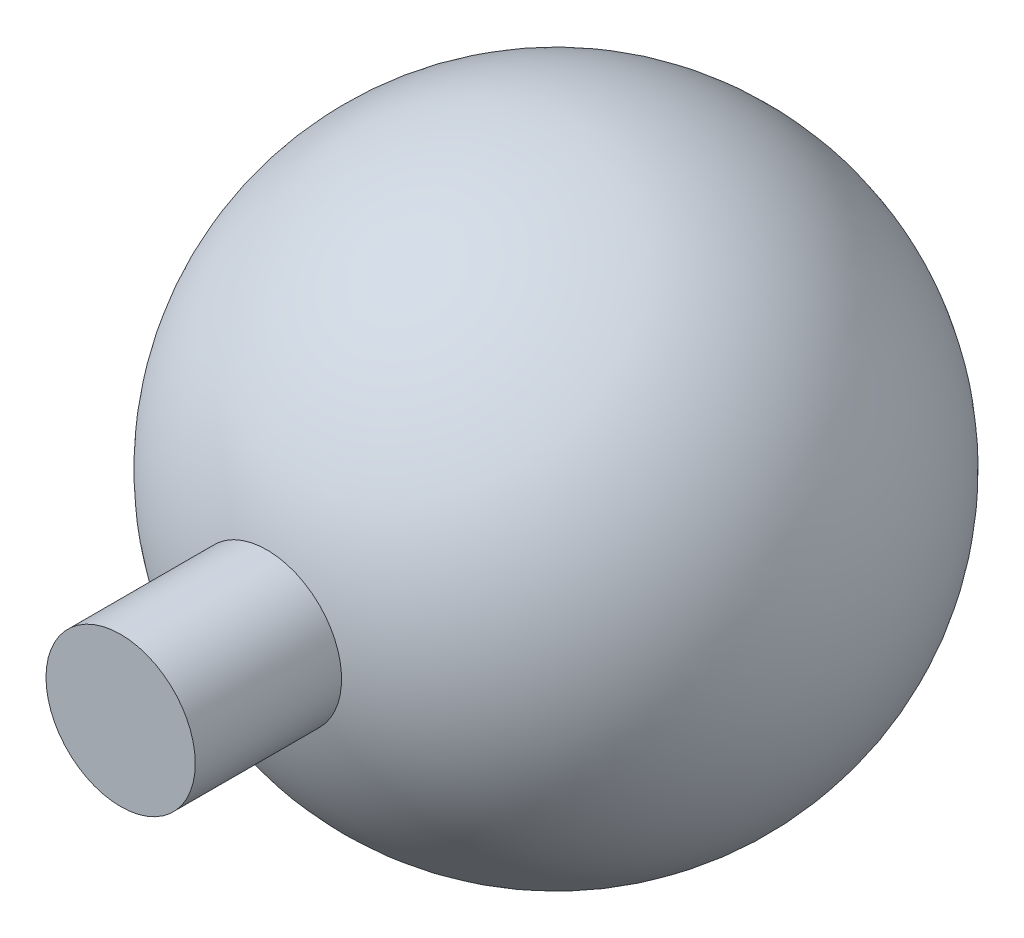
ISO-10303-21;
HEADER;
FILE_DESCRIPTION(('STEP AP214'),'2;1');
FILE_NAME('part.step','',(''),(''),'','','');
FILE_SCHEMA(('AUTOMOTIVE_DESIGN { 1 0 10303 214 1 1 1 1 }'));
ENDSEC;
DATA;
#1=APPLICATION_CONTEXT('core data for automotive mechanical design processes');
#2=APPLICATION_PROTOCOL_DEFINITION('international standard','automotive_design',2000,#1);
#3=PRODUCT_CONTEXT('',#1,'mechanical');
#4=PRODUCT('Part','Part','',(#3));
#5=PRODUCT_RELATED_PRODUCT_CATEGORY('part','',(#4));
#6=PRODUCT_DEFINITION_FORMATION('','',#4);
#7=PRODUCT_DEFINITION_CONTEXT('part definition',#1,'design');
#8=PRODUCT_DEFINITION('design','',#6,#7);
#9=PRODUCT_DEFINITION_SHAPE('','',#8);
#10=(LENGTH_UNIT() NAMED_UNIT(*) SI_UNIT(.MILLI.,.METRE.));
#11=(NAMED_UNIT(*) PLANE_ANGLE_UNIT() SI_UNIT($,.RADIAN.));
#12=(NAMED_UNIT(*) SI_UNIT($,.STERADIAN.) SOLID_ANGLE_UNIT());
#13=UNCERTAINTY_MEASURE_WITH_UNIT(LENGTH_MEASURE(1.E-05),#10,'distance_accuracy_value','');
#14=(GEOMETRIC_REPRESENTATION_CONTEXT(3) GLOBAL_UNCERTAINTY_ASSIGNED_CONTEXT((#13)) GLOBAL_UNIT_ASSIGNED_CONTEXT((#10,
#11,#12)) REPRESENTATION_CONTEXT('',''));
#15=CARTESIAN_POINT('',(0.,0.,0.));
#16=DIRECTION('',(0.,0.,1.));
#17=DIRECTION('',(1.,0.,0.));
#18=AXIS2_PLACEMENT_3D('',#15,#16,#17);
#19=CARTESIAN_POINT('',(0.,0.,70.));
#20=DIRECTION('',(0.,0.,-1.));
#21=DIRECTION('',(-1.,0.,0.));
#22=AXIS2_PLACEMENT_3D('',#19,#20,#21);
#23=CYLINDRICAL_SURFACE('',#22,12.);
#24=CARTESIAN_POINT('',(0.,0.,46.475800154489));
#25=DIRECTION('',(0.,0.,-1.));
#26=DIRECTION('',(-1.,0.,0.));
#27=AXIS2_PLACEMENT_3D('',#24,#25,#26);
#28=CIRCLE('',#27,12.);
#29=CARTESIAN_POINT('',(-12.,0.,46.475800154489));
#30=VERTEX_POINT('',#29);
#31=EDGE_CURVE('E10',#30,#30,#28,.T.);
#32=ORIENTED_EDGE('',*,*,#31,.F.);
#33=EDGE_LOOP('',(#32));
#34=FACE_BOUND('',#33,.T.);
#35=CARTESIAN_POINT('',(0.,0.,70.));
#36=DIRECTION('',(0.,0.,1.));
#37=DIRECTION('',(1.,0.,0.));
#38=AXIS2_PLACEMENT_3D('',#35,#36,#37);
#39=CIRCLE('',#38,12.);
#40=CARTESIAN_POINT('',(12.,0.,70.));
#41=VERTEX_POINT('',#40);
#42=EDGE_CURVE('E41',#41,#41,#39,.T.);
#43=ORIENTED_EDGE('',*,*,#42,.F.);
#44=EDGE_LOOP('',(#43));
#45=FACE_BOUND('',#44,.T.);
#46=ADVANCED_FACE('F34',(#34,#45),#23,.T.);
#47=CARTESIAN_POINT('',(0.,0.,70.));
#48=DIRECTION('',(0.,0.,1.));
#49=DIRECTION('',(1.,0.,0.));
#50=AXIS2_PLACEMENT_3D('',#47,#48,#49);
#51=PLANE('',#50);
#52=ORIENTED_EDGE('',*,*,#42,.T.);
#53=EDGE_LOOP('',(#52));
#54=FACE_BOUND('',#53,.T.);
#55=ADVANCED_FACE('F47',(#54),#51,.T.);
#56=CARTESIAN_POINT('',(0.,0.,0.));
#57=DIRECTION('',(0.,-1.,0.));
#58=DIRECTION('',(-1.,0.,0.));
#59=AXIS2_PLACEMENT_3D('',#56,#57,#58);
#60=SPHERICAL_SURFACE('',#59,48.);
#61=CARTESIAN_POINT('',(0.,0.,0.));
#62=DIRECTION('',(0.,0.,-1.));
#63=DIRECTION('',(-1.,0.,0.));
#64=AXIS2_PLACEMENT_3D('',#61,#62,#63);
#65=SPHERICAL_SURFACE('',#64,48.);
#66=ORIENTED_EDGE('',*,*,#31,.T.);
#67=EDGE_LOOP('',(#66));
#68=FACE_BOUND('',#67,.T.);
#69=ADVANCED_FACE('F36',(#68),#65,.T.);
#70=CLOSED_SHELL('',(#46,#55,#69));
#71=MANIFOLD_SOLID_BREP('B2',#70);
#72=ADVANCED_BREP_SHAPE_REPRESENTATION('',(#18,#71),#14);
#73=SHAPE_DEFINITION_REPRESENTATION(#9,#72);
ENDSEC;
END-ISO-10303-21;
